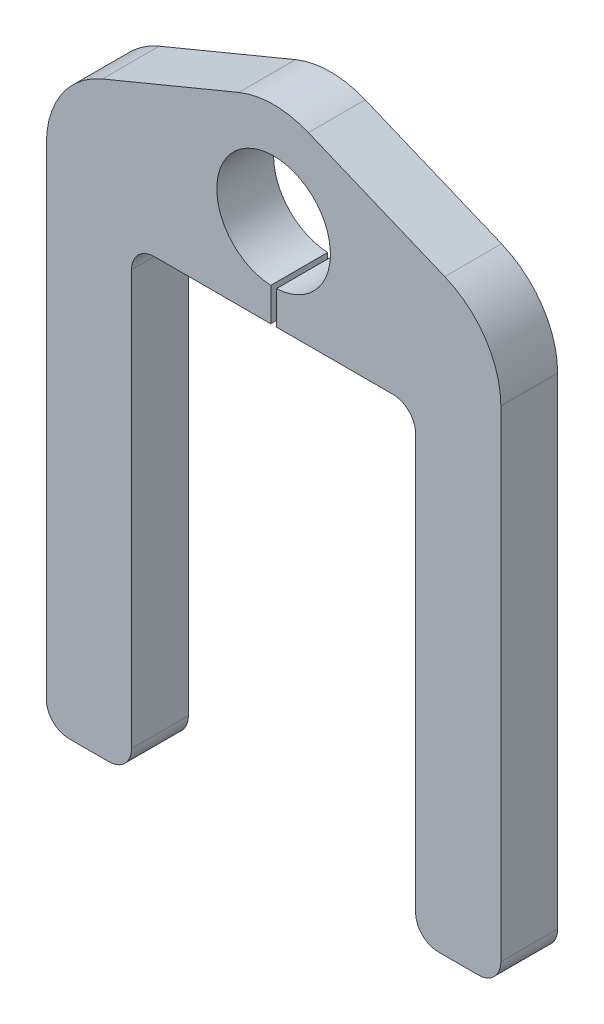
from build123d import *

# Parameters (mm, degrees)
EXTRUDE1_DEPTH = 31.75


with BuildPart() as part:
    # Sketch1 → Extrude1 (new body)
    with BuildSketch(Plane.XY):
        with BuildLine():
            Line((310.950381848, 299.85174436), (310.950381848, 318.474470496))
            ThreePointArc((310.950381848, 318.474470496), (309.362881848, 381.93475816), (307.775381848, 318.474470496))
            Line((307.775381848, 318.474470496), (307.775381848, 299.85174436))
            Line((307.775381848, 299.85174436), (242.687881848, 299.85174436))
            ThreePointArc((242.687881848, 299.85174436), (233.707625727, 296.132000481), (229.987881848, 287.15174436))
            Line((229.987881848, 287.15174436), (229.987881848, 55.37674436))
            ThreePointArc((229.987881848, 55.37674436), (226.268137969, 46.396488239), (217.287881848, 42.67674436))
            Line((217.287881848, 42.67674436), (195.062881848, 42.67674436))
            ThreePointArc((195.062881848, 42.67674436), (186.082625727, 46.396488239), (182.362881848, 55.37674436))
            Line((182.362881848, 55.37674436), (182.362881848, 324.393716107))
            ThreePointArc((182.362881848, 324.393716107), (190.91989069, 352.6101953), (213.70814555, 371.32082166))
            Line((213.70814555, 371.32082166), (289.90814555, 402.911325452))
            ThreePointArc((289.90814555, 402.911325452), (309.362881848, 406.784219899), (328.817618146, 402.911325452))
            Line((328.817618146, 402.911325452), (405.017618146, 371.32082166))
            ThreePointArc((405.017618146, 371.32082166), (427.805873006, 352.6101953), (436.362881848, 324.393716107))
            Line((436.362881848, 324.393716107), (436.362881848, 55.37674436))
            ThreePointArc((436.362881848, 55.37674436), (432.643137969, 46.396488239), (423.662881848, 42.67674436))
            Line((423.662881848, 42.67674436), (401.437881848, 42.67674436))
            ThreePointArc((401.437881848, 42.67674436), (392.457625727, 46.396488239), (388.737881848, 55.37674436))
            Line((388.737881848, 55.37674436), (388.737881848, 287.15174436))
            ThreePointArc((388.737881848, 287.15174436), (385.018137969, 296.132000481), (376.037881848, 299.85174436))
            Line((376.037881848, 299.85174436), (310.950381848, 299.85174436))
        make_face()
    extrude(amount=EXTRUDE1_DEPTH)


solid = part.part
